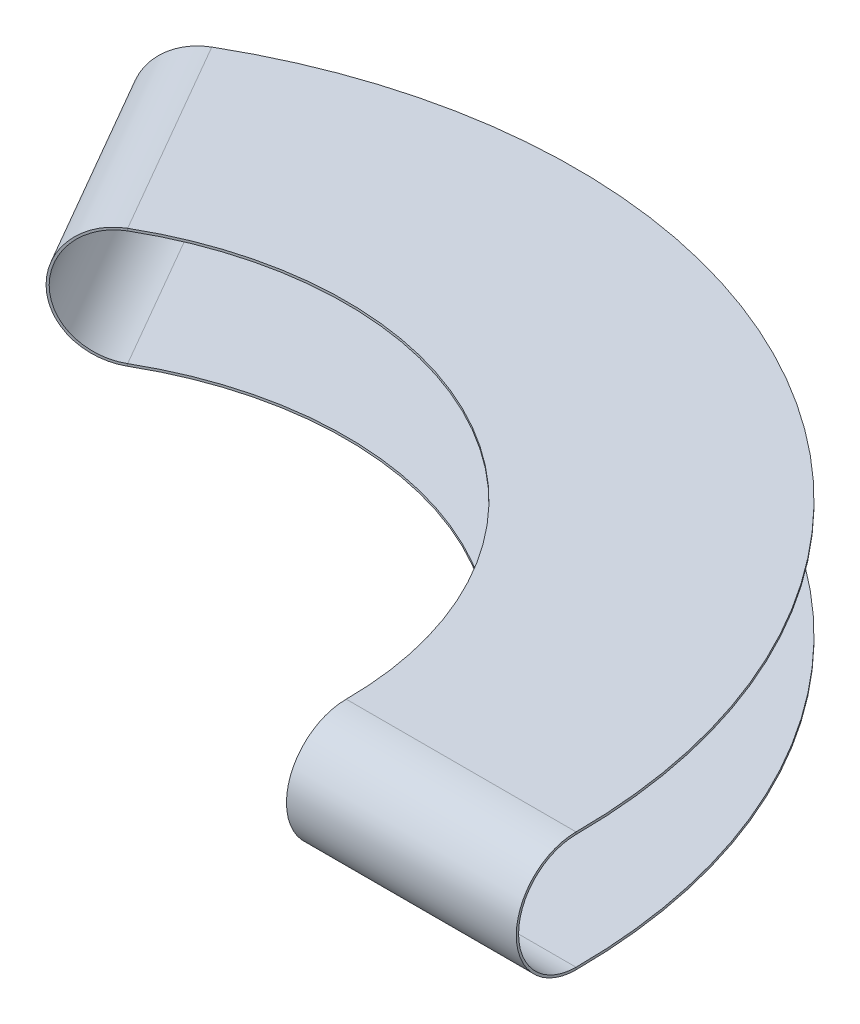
from build123d import *

# Parameters (mm, degrees)
LINEAR_AUSTRAGEN1_DEPTH = 100
LINEAR_AUSTRAGEN2_DEPTH = 200
LINEAR_AUSTRAGEN3_DEPTH = 200
WANDUNG1_T              = 2


with BuildPart() as part:
    # Skizze1 → Linear austragen1 (new body)
    with BuildSketch(Plane(origin=(0, 0, 0), x_dir=(1, 0, 0), z_dir=(0, 1, 0))):
        with BuildLine():
            Line((300, 0), (500, 0))
            ThreePointArc((500, 0), (250, 433.012701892), (-250, 433.012701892))
            Line((-250, 433.012701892), (-150, 259.807621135))
            ThreePointArc((-150, 259.807621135), (150, 259.807621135), (300, 0))
        make_face()
    extrude(amount=LINEAR_AUSTRAGEN1_DEPTH)

    # Skizze2 → Linear austragen2 (add, through all)
    with BuildSketch(Plane(origin=(300, 100, 0), x_dir=(0, 0, -1), z_dir=(1, 0, 0))):
        with BuildLine():
            Line((0, 0), (0, -100))
            ThreePointArc((0, -100), (-50, -50), (0, 0))
        make_face()
    extrude(amount=LINEAR_AUSTRAGEN2_DEPTH)

    # Skizze3 → Linear austragen3 (add)
    with BuildSketch(Plane(origin=(-150, 100, -259.807621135), x_dir=(0.866025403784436, 0, -0.5000000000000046), z_dir=(0.5000000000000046, 0, 0.866025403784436))):
        with BuildLine():
            Line((0, 0), (0, -100))
            ThreePointArc((0, -100), (-50, -50), (0, 0))
        make_face()
    extrude(amount=-LINEAR_AUSTRAGEN3_DEPTH)

    # Wandung1
    wandung1_openings = [part.faces().sort_by_distance(p)[0] for p in [
        (250, 50, -433.012701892),
        (500, 50, 21.220659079),
        (-268.377629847, 50, -422.402372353),
        (150, 50, -259.807621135),
        (300, 50, 21.220659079),
        (-168.377629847, 50, -249.197291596),
    ]]
    offset(amount=WANDUNG1_T, openings=wandung1_openings, kind=Kind.INTERSECTION)


solid = part.part
